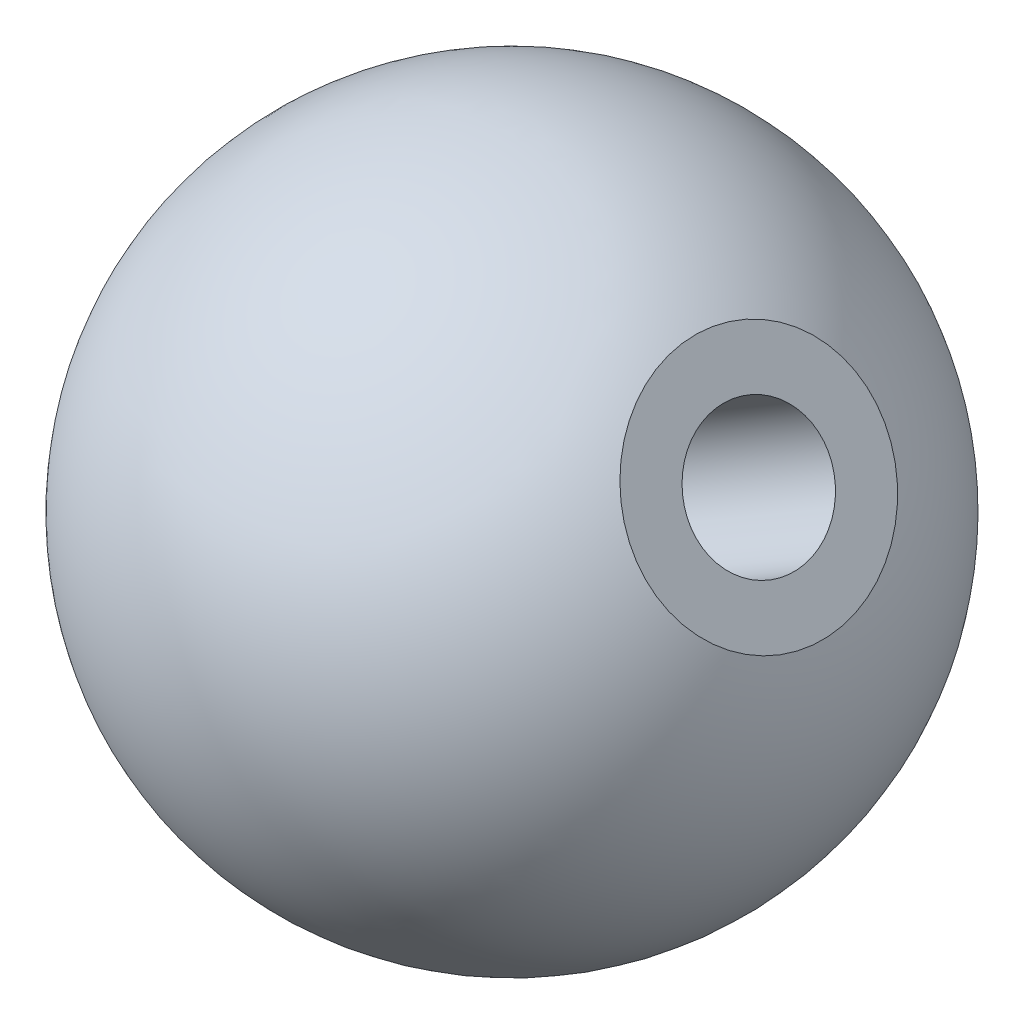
ISO-10303-21;
HEADER;
FILE_DESCRIPTION(('STEP AP214'),'2;1');
FILE_NAME('part.step','',(''),(''),'','','');
FILE_SCHEMA(('AUTOMOTIVE_DESIGN { 1 0 10303 214 1 1 1 1 }'));
ENDSEC;
DATA;
#1=APPLICATION_CONTEXT('core data for automotive mechanical design processes');
#2=APPLICATION_PROTOCOL_DEFINITION('international standard','automotive_design',2000,#1);
#3=PRODUCT_CONTEXT('',#1,'mechanical');
#4=PRODUCT('Part','Part','',(#3));
#5=PRODUCT_RELATED_PRODUCT_CATEGORY('part','',(#4));
#6=PRODUCT_DEFINITION_FORMATION('','',#4);
#7=PRODUCT_DEFINITION_CONTEXT('part definition',#1,'design');
#8=PRODUCT_DEFINITION('design','',#6,#7);
#9=PRODUCT_DEFINITION_SHAPE('','',#8);
#10=(LENGTH_UNIT() NAMED_UNIT(*) SI_UNIT(.MILLI.,.METRE.));
#11=(NAMED_UNIT(*) PLANE_ANGLE_UNIT() SI_UNIT($,.RADIAN.));
#12=(NAMED_UNIT(*) SI_UNIT($,.STERADIAN.) SOLID_ANGLE_UNIT());
#13=UNCERTAINTY_MEASURE_WITH_UNIT(LENGTH_MEASURE(1.E-05),#10,'distance_accuracy_value','');
#14=(GEOMETRIC_REPRESENTATION_CONTEXT(3) GLOBAL_UNCERTAINTY_ASSIGNED_CONTEXT((#13)) GLOBAL_UNIT_ASSIGNED_CONTEXT((#10,
#11,#12)) REPRESENTATION_CONTEXT('',''));
#15=CARTESIAN_POINT('',(0.,0.,0.));
#16=DIRECTION('',(0.,0.,1.));
#17=DIRECTION('',(1.,0.,0.));
#18=AXIS2_PLACEMENT_3D('',#15,#16,#17);
#19=CARTESIAN_POINT('',(8.95247297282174,5.46218678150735,0.51743911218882));
#20=DIRECTION('',(0.85261647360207,0.520208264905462,0.0492799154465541));
#21=DIRECTION('',(-0.520841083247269,0.853653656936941,0.));
#22=AXIS2_PLACEMENT_3D('',#19,#20,#21);
#23=CYLINDRICAL_SURFACE('',#22,2.1);
#24=CARTESIAN_POINT('',(-1.61997129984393,-0.988395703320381,-0.0936318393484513));
#25=DIRECTION('',(0.85261647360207,0.520208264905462,0.0492799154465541));
#26=DIRECTION('',(-0.520841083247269,0.853653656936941,0.));
#27=AXIS2_PLACEMENT_3D('',#24,#25,#26);
#28=CIRCLE('',#27,2.1);
#29=CARTESIAN_POINT('',(-2.7137375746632,0.804276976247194,-0.0936318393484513));
#30=VERTEX_POINT('',#29);
#31=EDGE_CURVE('E11',#30,#30,#28,.T.);
#32=ORIENTED_EDGE('',*,*,#31,.F.);
#33=EDGE_LOOP('',(#32));
#34=FACE_BOUND('',#33,.T.);
#35=CARTESIAN_POINT('',(8.34528805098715,5.09172406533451,0.482344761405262));
#36=DIRECTION('',(0.85261647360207,0.520208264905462,0.0492799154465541));
#37=DIRECTION('',(-0.520841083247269,0.853653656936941,0.));
#38=AXIS2_PLACEMENT_3D('',#35,#36,#37);
#39=CIRCLE('',#38,2.1);
#40=CARTESIAN_POINT('',(7.25152177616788,6.88439674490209,0.482344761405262));
#41=VERTEX_POINT('',#40);
#42=EDGE_CURVE('E38',#41,#41,#39,.F.);
#43=ORIENTED_EDGE('',*,*,#42,.F.);
#44=EDGE_LOOP('',(#43));
#45=FACE_BOUND('',#44,.T.);
#46=ADVANCED_FACE('F34',(#34,#45),#23,.F.);
#47=CARTESIAN_POINT('',(-1.61997129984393,-0.988395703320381,-0.0936318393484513));
#48=DIRECTION('',(0.85261647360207,0.520208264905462,0.0492799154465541));
#49=DIRECTION('',(-0.520841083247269,0.853653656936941,0.));
#50=AXIS2_PLACEMENT_3D('',#47,#48,#49);
#51=CONICAL_SURFACE('',#50,2.1,1.02974425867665);
#52=CARTESIAN_POINT('',(-2.69580899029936,-1.64479828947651,-0.155813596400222));
#53=VERTEX_POINT('',#52);
#54=VERTEX_LOOP('',#53);
#55=FACE_BOUND('',#54,.T.);
#56=ORIENTED_EDGE('',*,*,#31,.T.);
#57=EDGE_LOOP('',(#56));
#58=FACE_BOUND('',#57,.T.);
#59=ADVANCED_FACE('F45',(#55,#58),#51,.F.);
#60=CARTESIAN_POINT('',(8.34528805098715,5.09172406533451,0.482344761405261));
#61=DIRECTION('',(0.85261647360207,0.520208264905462,0.0492799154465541));
#62=DIRECTION('',(-0.520841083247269,0.853653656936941,0.));
#63=AXIS2_PLACEMENT_3D('',#60,#61,#62);
#64=PLANE('',#63);
#65=ORIENTED_EDGE('',*,*,#42,.T.);
#66=EDGE_LOOP('',(#65));
#67=FACE_BOUND('',#66,.T.);
#68=CARTESIAN_POINT('',(8.34528805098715,5.09172406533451,0.48234476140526));
#69=DIRECTION('',(0.85261647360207,0.520208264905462,0.0492799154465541));
#70=DIRECTION('',(-0.520841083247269,0.853653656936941,0.));
#71=AXIS2_PLACEMENT_3D('',#68,#69,#70);
#72=CIRCLE('',#71,3.80103366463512);
#73=CARTESIAN_POINT('',(6.36555355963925,8.3364903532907,0.48234476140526));
#74=VERTEX_POINT('',#73);
#75=EDGE_CURVE('E42',#74,#74,#72,.T.);
#76=ORIENTED_EDGE('',*,*,#75,.T.);
#77=EDGE_LOOP('',(#76));
#78=FACE_BOUND('',#77,.T.);
#79=ADVANCED_FACE('F48',(#67,#78),#64,.T.);
#80=CARTESIAN_POINT('',(0.,0.,0.));
#81=DIRECTION('',(0.,-1.,0.));
#82=DIRECTION('',(-1.,0.,0.));
#83=AXIS2_PLACEMENT_3D('',#80,#81,#82);
#84=SPHERICAL_SURFACE('',#83,10.5);
#85=CARTESIAN_POINT('',(0.,0.,0.));
#86=DIRECTION('',(0.85261647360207,0.520208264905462,0.0492799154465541));
#87=DIRECTION('',(-0.520841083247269,0.853653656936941,0.));
#88=AXIS2_PLACEMENT_3D('',#85,#86,#87);
#89=SPHERICAL_SURFACE('',#88,10.5);
#90=ORIENTED_EDGE('',*,*,#75,.F.);
#91=EDGE_LOOP('',(#90));
#92=FACE_BOUND('',#91,.T.);
#93=ADVANCED_FACE('F36',(#92),#89,.T.);
#94=CLOSED_SHELL('',(#46,#59,#79,#93));
#95=MANIFOLD_SOLID_BREP('B2',#94);
#96=ADVANCED_BREP_SHAPE_REPRESENTATION('',(#18,#95),#14);
#97=SHAPE_DEFINITION_REPRESENTATION(#9,#96);
ENDSEC;
END-ISO-10303-21;
